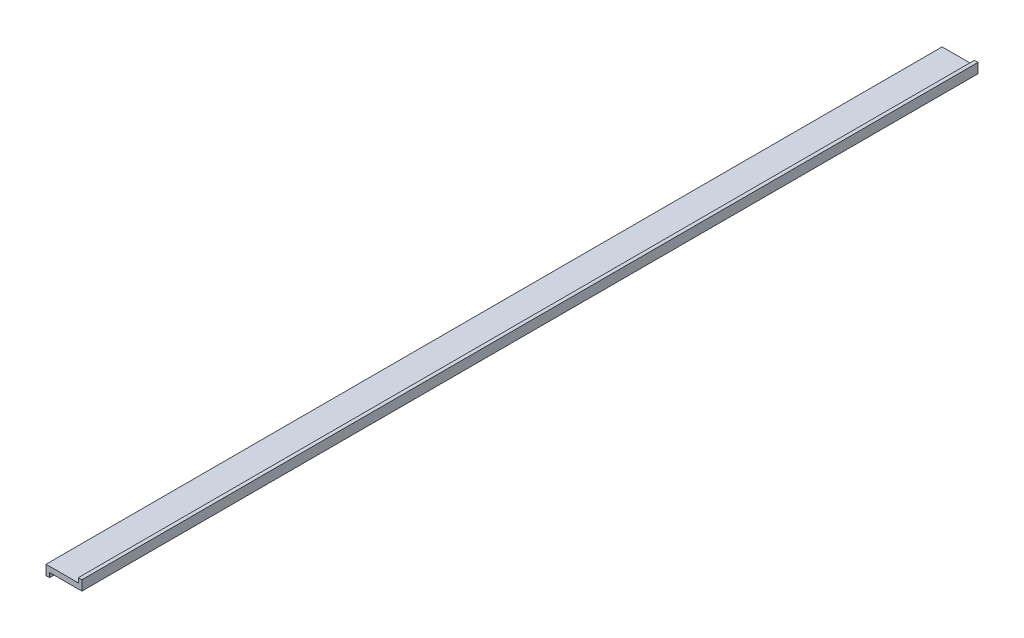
ISO-10303-21;
HEADER;
FILE_DESCRIPTION(('STEP AP214'),'2;1');
FILE_NAME('part.step','',(''),(''),'','','');
FILE_SCHEMA(('AUTOMOTIVE_DESIGN { 1 0 10303 214 1 1 1 1 }'));
ENDSEC;
DATA;
#1=APPLICATION_CONTEXT('core data for automotive mechanical design processes');
#2=APPLICATION_PROTOCOL_DEFINITION('international standard','automotive_design',2000,#1);
#3=PRODUCT_CONTEXT('',#1,'mechanical');
#4=PRODUCT('Part','Part','',(#3));
#5=PRODUCT_RELATED_PRODUCT_CATEGORY('part','',(#4));
#6=PRODUCT_DEFINITION_FORMATION('','',#4);
#7=PRODUCT_DEFINITION_CONTEXT('part definition',#1,'design');
#8=PRODUCT_DEFINITION('design','',#6,#7);
#9=PRODUCT_DEFINITION_SHAPE('','',#8);
#10=(LENGTH_UNIT() NAMED_UNIT(*) SI_UNIT(.MILLI.,.METRE.));
#11=(NAMED_UNIT(*) PLANE_ANGLE_UNIT() SI_UNIT($,.RADIAN.));
#12=(NAMED_UNIT(*) SI_UNIT($,.STERADIAN.) SOLID_ANGLE_UNIT());
#13=UNCERTAINTY_MEASURE_WITH_UNIT(LENGTH_MEASURE(1.E-05),#10,'distance_accuracy_value','');
#14=(GEOMETRIC_REPRESENTATION_CONTEXT(3) GLOBAL_UNCERTAINTY_ASSIGNED_CONTEXT((#13)) GLOBAL_UNIT_ASSIGNED_CONTEXT((#10,
#11,#12)) REPRESENTATION_CONTEXT('',''));
#15=CARTESIAN_POINT('',(0.,0.,0.));
#16=DIRECTION('',(0.,0.,1.));
#17=DIRECTION('',(1.,0.,0.));
#18=AXIS2_PLACEMENT_3D('',#15,#16,#17);
#19=CARTESIAN_POINT('',(-8.,0.,500.));
#20=DIRECTION('',(-1.,0.,0.));
#21=DIRECTION('',(0.,0.,1.));
#22=AXIS2_PLACEMENT_3D('',#19,#20,#21);
#23=PLANE('',#22);
#24=DIRECTION('',(0.,1.,0.));
#25=VECTOR('',#24,1.);
#26=CARTESIAN_POINT('',(-8.,0.,0.));
#27=LINE('',#26,#25);
#28=CARTESIAN_POINT('',(-8.,-2.5,0.));
#29=VERTEX_POINT('',#28);
#30=CARTESIAN_POINT('',(-8.,0.,0.));
#31=VERTEX_POINT('',#30);
#32=EDGE_CURVE('E110',#29,#31,#27,.T.);
#33=ORIENTED_EDGE('',*,*,#32,.T.);
#34=DIRECTION('',(0.,0.,-1.));
#35=VECTOR('',#34,1.);
#36=CARTESIAN_POINT('',(-8.,0.,500.));
#37=LINE('',#36,#35);
#38=CARTESIAN_POINT('',(-8.,0.,500.));
#39=VERTEX_POINT('',#38);
#40=EDGE_CURVE('E9',#39,#31,#37,.T.);
#41=ORIENTED_EDGE('',*,*,#40,.F.);
#42=DIRECTION('',(0.,1.,0.));
#43=VECTOR('',#42,1.);
#44=CARTESIAN_POINT('',(-8.,0.,500.));
#45=LINE('',#44,#43);
#46=CARTESIAN_POINT('',(-8.,-2.5,500.));
#47=VERTEX_POINT('',#46);
#48=EDGE_CURVE('E124',#47,#39,#45,.T.);
#49=ORIENTED_EDGE('',*,*,#48,.F.);
#50=DIRECTION('',(0.,0.,-1.));
#51=VECTOR('',#50,1.);
#52=CARTESIAN_POINT('',(-8.,-2.5,500.));
#53=LINE('',#52,#51);
#54=EDGE_CURVE('E106',#47,#29,#53,.T.);
#55=ORIENTED_EDGE('',*,*,#54,.T.);
#56=EDGE_LOOP('',(#33,#41,#49,#55));
#57=FACE_BOUND('',#56,.T.);
#58=ADVANCED_FACE('F14',(#57),#23,.F.);
#59=CARTESIAN_POINT('',(-8.,0.,500.));
#60=DIRECTION('',(0.,1.,0.));
#61=DIRECTION('',(-1.,0.,0.));
#62=AXIS2_PLACEMENT_3D('',#59,#60,#61);
#63=PLANE('',#62);
#64=DIRECTION('',(1.,0.,0.));
#65=VECTOR('',#64,1.);
#66=CARTESIAN_POINT('',(-8.,0.,0.));
#67=LINE('',#66,#65);
#68=CARTESIAN_POINT('',(10.,0.,0.));
#69=VERTEX_POINT('',#68);
#70=EDGE_CURVE('E113',#31,#69,#67,.T.);
#71=ORIENTED_EDGE('',*,*,#70,.T.);
#72=DIRECTION('',(0.,0.,-1.));
#73=VECTOR('',#72,1.);
#74=CARTESIAN_POINT('',(10.,0.,500.));
#75=LINE('',#74,#73);
#76=CARTESIAN_POINT('',(10.,0.,500.));
#77=VERTEX_POINT('',#76);
#78=EDGE_CURVE('E22',#77,#69,#75,.T.);
#79=ORIENTED_EDGE('',*,*,#78,.F.);
#80=DIRECTION('',(1.,0.,0.));
#81=VECTOR('',#80,1.);
#82=CARTESIAN_POINT('',(-8.,0.,500.));
#83=LINE('',#82,#81);
#84=EDGE_CURVE('E73',#39,#77,#83,.T.);
#85=ORIENTED_EDGE('',*,*,#84,.F.);
#86=ORIENTED_EDGE('',*,*,#40,.T.);
#87=EDGE_LOOP('',(#71,#79,#85,#86));
#88=FACE_BOUND('',#87,.T.);
#89=ADVANCED_FACE('F159',(#88),#63,.F.);
#90=CARTESIAN_POINT('',(10.,5.5,500.));
#91=DIRECTION('',(-1.,0.,0.));
#92=DIRECTION('',(0.,0.,1.));
#93=AXIS2_PLACEMENT_3D('',#90,#91,#92);
#94=PLANE('',#93);
#95=DIRECTION('',(0.,1.,0.));
#96=VECTOR('',#95,1.);
#97=CARTESIAN_POINT('',(10.,5.5,0.));
#98=LINE('',#97,#96);
#99=CARTESIAN_POINT('',(10.,5.5,0.));
#100=VERTEX_POINT('',#99);
#101=EDGE_CURVE('E115',#69,#100,#98,.T.);
#102=ORIENTED_EDGE('',*,*,#101,.T.);
#103=DIRECTION('',(0.,0.,-1.));
#104=VECTOR('',#103,1.);
#105=CARTESIAN_POINT('',(10.,5.5,500.));
#106=LINE('',#105,#104);
#107=CARTESIAN_POINT('',(10.,5.5,500.));
#108=VERTEX_POINT('',#107);
#109=EDGE_CURVE('E131',#108,#100,#106,.T.);
#110=ORIENTED_EDGE('',*,*,#109,.F.);
#111=DIRECTION('',(0.,1.,0.));
#112=VECTOR('',#111,1.);
#113=CARTESIAN_POINT('',(10.,5.5,500.));
#114=LINE('',#113,#112);
#115=EDGE_CURVE('E139',#77,#108,#114,.T.);
#116=ORIENTED_EDGE('',*,*,#115,.F.);
#117=ORIENTED_EDGE('',*,*,#78,.T.);
#118=EDGE_LOOP('',(#102,#110,#116,#117));
#119=FACE_BOUND('',#118,.T.);
#120=ADVANCED_FACE('F137',(#119),#94,.F.);
#121=CARTESIAN_POINT('',(8.,5.5,500.));
#122=DIRECTION('',(0.,-1.,0.));
#123=DIRECTION('',(0.,0.,-1.));
#124=AXIS2_PLACEMENT_3D('',#121,#122,#123);
#125=PLANE('',#124);
#126=DIRECTION('',(-1.,0.,0.));
#127=VECTOR('',#126,1.);
#128=CARTESIAN_POINT('',(8.,5.5,0.));
#129=LINE('',#128,#127);
#130=CARTESIAN_POINT('',(8.,5.5,0.));
#131=VERTEX_POINT('',#130);
#132=EDGE_CURVE('E117',#100,#131,#129,.T.);
#133=ORIENTED_EDGE('',*,*,#132,.T.);
#134=DIRECTION('',(0.,0.,-1.));
#135=VECTOR('',#134,1.);
#136=CARTESIAN_POINT('',(8.,5.5,500.));
#137=LINE('',#136,#135);
#138=CARTESIAN_POINT('',(8.,5.5,500.));
#139=VERTEX_POINT('',#138);
#140=EDGE_CURVE('E128',#139,#131,#137,.T.);
#141=ORIENTED_EDGE('',*,*,#140,.F.);
#142=DIRECTION('',(-1.,0.,0.));
#143=VECTOR('',#142,1.);
#144=CARTESIAN_POINT('',(8.,5.5,500.));
#145=LINE('',#144,#143);
#146=EDGE_CURVE('E151',#108,#139,#145,.T.);
#147=ORIENTED_EDGE('',*,*,#146,.F.);
#148=ORIENTED_EDGE('',*,*,#109,.T.);
#149=EDGE_LOOP('',(#133,#141,#147,#148));
#150=FACE_BOUND('',#149,.T.);
#151=ADVANCED_FACE('F147',(#150),#125,.F.);
#152=CARTESIAN_POINT('',(8.,5.5,500.));
#153=DIRECTION('',(1.,0.,0.));
#154=DIRECTION('',(0.,1.,0.));
#155=AXIS2_PLACEMENT_3D('',#152,#153,#154);
#156=PLANE('',#155);
#157=DIRECTION('',(0.,-1.,0.));
#158=VECTOR('',#157,1.);
#159=CARTESIAN_POINT('',(8.,5.5,0.));
#160=LINE('',#159,#158);
#161=CARTESIAN_POINT('',(8.,3.,0.));
#162=VERTEX_POINT('',#161);
#163=EDGE_CURVE('E119',#131,#162,#160,.T.);
#164=ORIENTED_EDGE('',*,*,#163,.T.);
#165=DIRECTION('',(0.,0.,-1.));
#166=VECTOR('',#165,1.);
#167=CARTESIAN_POINT('',(8.,3.,500.));
#168=LINE('',#167,#166);
#169=CARTESIAN_POINT('',(8.,3.,500.));
#170=VERTEX_POINT('',#169);
#171=EDGE_CURVE('E101',#170,#162,#168,.T.);
#172=ORIENTED_EDGE('',*,*,#171,.F.);
#173=DIRECTION('',(0.,-1.,0.));
#174=VECTOR('',#173,1.);
#175=CARTESIAN_POINT('',(8.,5.5,500.));
#176=LINE('',#175,#174);
#177=EDGE_CURVE('E92',#139,#170,#176,.T.);
#178=ORIENTED_EDGE('',*,*,#177,.F.);
#179=ORIENTED_EDGE('',*,*,#140,.T.);
#180=EDGE_LOOP('',(#164,#172,#178,#179));
#181=FACE_BOUND('',#180,.T.);
#182=ADVANCED_FACE('F150',(#181),#156,.F.);
#183=CARTESIAN_POINT('',(-10.,3.,500.));
#184=DIRECTION('',(0.,-1.,0.));
#185=DIRECTION('',(0.,0.,-1.));
#186=AXIS2_PLACEMENT_3D('',#183,#184,#185);
#187=PLANE('',#186);
#188=DIRECTION('',(-1.,0.,0.));
#189=VECTOR('',#188,1.);
#190=CARTESIAN_POINT('',(-10.,3.,0.));
#191=LINE('',#190,#189);
#192=CARTESIAN_POINT('',(-10.,3.,0.));
#193=VERTEX_POINT('',#192);
#194=EDGE_CURVE('E100',#162,#193,#191,.T.);
#195=ORIENTED_EDGE('',*,*,#194,.T.);
#196=DIRECTION('',(0.,0.,-1.));
#197=VECTOR('',#196,1.);
#198=CARTESIAN_POINT('',(-10.,3.,500.));
#199=LINE('',#198,#197);
#200=CARTESIAN_POINT('',(-10.,3.,500.));
#201=VERTEX_POINT('',#200);
#202=EDGE_CURVE('E97',#201,#193,#199,.T.);
#203=ORIENTED_EDGE('',*,*,#202,.F.);
#204=DIRECTION('',(-1.,0.,0.));
#205=VECTOR('',#204,1.);
#206=CARTESIAN_POINT('',(-10.,3.,500.));
#207=LINE('',#206,#205);
#208=EDGE_CURVE('E86',#170,#201,#207,.T.);
#209=ORIENTED_EDGE('',*,*,#208,.F.);
#210=ORIENTED_EDGE('',*,*,#171,.T.);
#211=EDGE_LOOP('',(#195,#203,#209,#210));
#212=FACE_BOUND('',#211,.T.);
#213=ADVANCED_FACE('F98',(#212),#187,.F.);
#214=CARTESIAN_POINT('',(-10.,3.,500.));
#215=DIRECTION('',(1.,0.,0.));
#216=DIRECTION('',(0.,0.,-1.));
#217=AXIS2_PLACEMENT_3D('',#214,#215,#216);
#218=PLANE('',#217);
#219=DIRECTION('',(0.,-1.,0.));
#220=VECTOR('',#219,1.);
#221=CARTESIAN_POINT('',(-10.,3.,0.));
#222=LINE('',#221,#220);
#223=CARTESIAN_POINT('',(-10.,-2.5,0.));
#224=VERTEX_POINT('',#223);
#225=EDGE_CURVE('E59',#193,#224,#222,.T.);
#226=ORIENTED_EDGE('',*,*,#225,.T.);
#227=DIRECTION('',(0.,0.,-1.));
#228=VECTOR('',#227,1.);
#229=CARTESIAN_POINT('',(-10.,-2.5,500.));
#230=LINE('',#229,#228);
#231=CARTESIAN_POINT('',(-10.,-2.5,500.));
#232=VERTEX_POINT('',#231);
#233=EDGE_CURVE('E102',#232,#224,#230,.T.);
#234=ORIENTED_EDGE('',*,*,#233,.F.);
#235=DIRECTION('',(0.,-1.,0.));
#236=VECTOR('',#235,1.);
#237=CARTESIAN_POINT('',(-10.,3.,500.));
#238=LINE('',#237,#236);
#239=EDGE_CURVE('E90',#201,#232,#238,.T.);
#240=ORIENTED_EDGE('',*,*,#239,.F.);
#241=ORIENTED_EDGE('',*,*,#202,.T.);
#242=EDGE_LOOP('',(#226,#234,#240,#241));
#243=FACE_BOUND('',#242,.T.);
#244=ADVANCED_FACE('F104',(#243),#218,.F.);
#245=CARTESIAN_POINT('',(-10.,-2.5,500.));
#246=DIRECTION('',(0.,1.,0.));
#247=DIRECTION('',(0.,0.,1.));
#248=AXIS2_PLACEMENT_3D('',#245,#246,#247);
#249=PLANE('',#248);
#250=DIRECTION('',(1.,0.,0.));
#251=VECTOR('',#250,1.);
#252=CARTESIAN_POINT('',(-10.,-2.5,0.));
#253=LINE('',#252,#251);
#254=EDGE_CURVE('E65',#224,#29,#253,.T.);
#255=ORIENTED_EDGE('',*,*,#254,.T.);
#256=ORIENTED_EDGE('',*,*,#54,.F.);
#257=DIRECTION('',(1.,0.,0.));
#258=VECTOR('',#257,1.);
#259=CARTESIAN_POINT('',(-10.,-2.5,500.));
#260=LINE('',#259,#258);
#261=EDGE_CURVE('E30',#232,#47,#260,.T.);
#262=ORIENTED_EDGE('',*,*,#261,.F.);
#263=ORIENTED_EDGE('',*,*,#233,.T.);
#264=EDGE_LOOP('',(#255,#256,#262,#263));
#265=FACE_BOUND('',#264,.T.);
#266=ADVANCED_FACE('F176',(#265),#249,.F.);
#267=CARTESIAN_POINT('',(-8.,-2.5,500.));
#268=DIRECTION('',(0.,0.,1.));
#269=DIRECTION('',(1.,0.,0.));
#270=AXIS2_PLACEMENT_3D('',#267,#268,#269);
#271=PLANE('',#270);
#272=ORIENTED_EDGE('',*,*,#48,.T.);
#273=ORIENTED_EDGE('',*,*,#84,.T.);
#274=ORIENTED_EDGE('',*,*,#115,.T.);
#275=ORIENTED_EDGE('',*,*,#146,.T.);
#276=ORIENTED_EDGE('',*,*,#177,.T.);
#277=ORIENTED_EDGE('',*,*,#208,.T.);
#278=ORIENTED_EDGE('',*,*,#239,.T.);
#279=ORIENTED_EDGE('',*,*,#261,.T.);
#280=EDGE_LOOP('',(#272,#273,#274,#275,#276,#277,#278,#279));
#281=FACE_BOUND('',#280,.T.);
#282=ADVANCED_FACE('F88',(#281),#271,.T.);
#283=CARTESIAN_POINT('',(-8.,-2.5,0.));
#284=DIRECTION('',(0.,0.,1.));
#285=DIRECTION('',(1.,0.,0.));
#286=AXIS2_PLACEMENT_3D('',#283,#284,#285);
#287=PLANE('',#286);
#288=ORIENTED_EDGE('',*,*,#32,.F.);
#289=ORIENTED_EDGE('',*,*,#254,.F.);
#290=ORIENTED_EDGE('',*,*,#225,.F.);
#291=ORIENTED_EDGE('',*,*,#194,.F.);
#292=ORIENTED_EDGE('',*,*,#163,.F.);
#293=ORIENTED_EDGE('',*,*,#132,.F.);
#294=ORIENTED_EDGE('',*,*,#101,.F.);
#295=ORIENTED_EDGE('',*,*,#70,.F.);
#296=EDGE_LOOP('',(#288,#289,#290,#291,#292,#293,#294,#295));
#297=FACE_BOUND('',#296,.T.);
#298=ADVANCED_FACE('F143',(#297),#287,.F.);
#299=CLOSED_SHELL('',(#58,#89,#120,#151,#182,#213,#244,#266,#282,#298));
#300=MANIFOLD_SOLID_BREP('B1',#299);
#301=ADVANCED_BREP_SHAPE_REPRESENTATION('',(#18,#300),#14);
#302=SHAPE_DEFINITION_REPRESENTATION(#9,#301);
ENDSEC;
END-ISO-10303-21;
